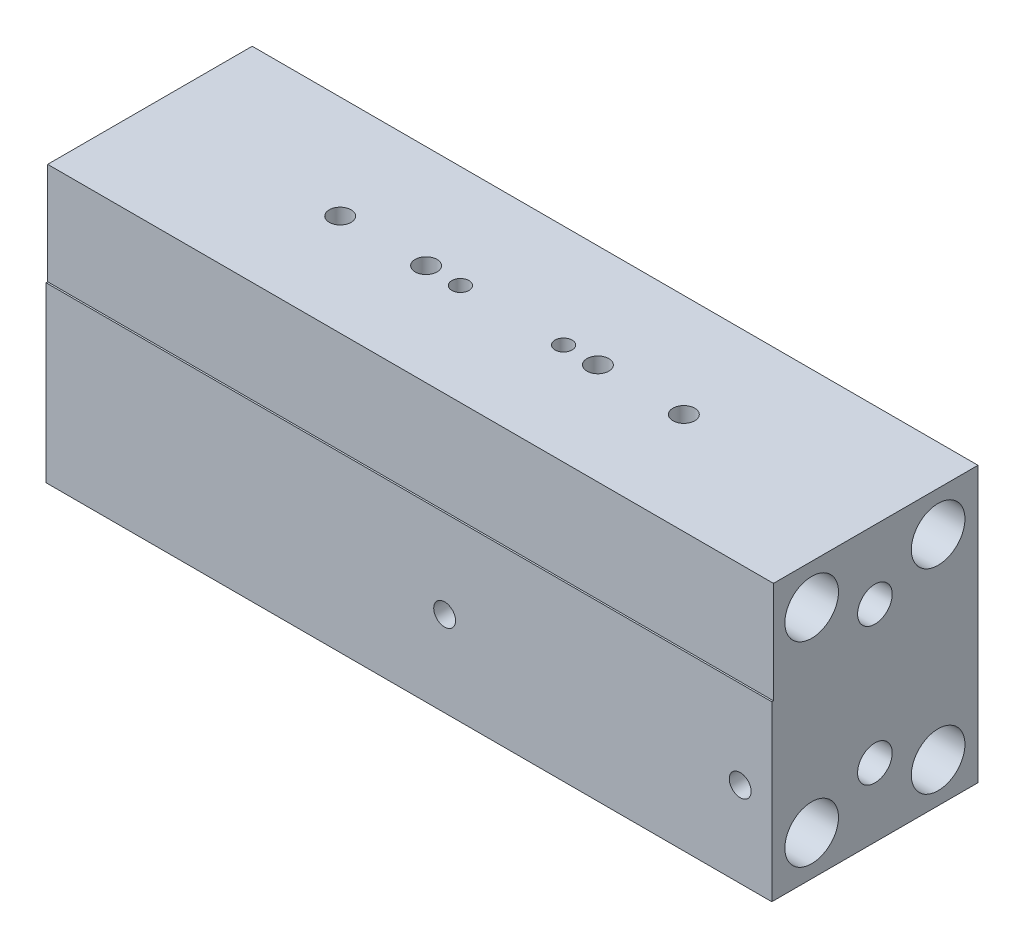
from build123d import *

# Parameters (mm, degrees)
SKETCH1_W                        = 134.112
SKETCH1_H                        = 50.8
EXTRUDE1_DEPTH                   = 38.1
SKETCH22_W                       = 0.3048
SKETCH22_H                       = 18.796
CUT_EXTRUDE1_DEPTH               = 134.112
F_1_8_0_125_DIAMETER_HOLE3_D     = 3.175
F_1_8_0_125_DIAMETER_HOLE3_DEPTH = 6.35
F_1_8_0_125_DIAMETER_HOLE3_TIP   = 0.953866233
SKETCH26_R                       = 4.953
SKETCH26_R_2                     = 3.2004
CUT_EXTRUDE2_DEPTH               = 138.819051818
F_8_32_TAPPED_HOLE1_D            = 3.4544
F_8_32_TAPPED_HOLE1_DEPTH        = 7.1374
F_8_32_TAPPED_HOLE1_TIP          = 0.997199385
F_10_32_TAPPED_HOLE2_D           = 4.0386
F_10_32_TAPPED_HOLE2_DEPTH       = 12.0396
F_10_32_TAPPED_HOLE2_TIP         = 1.165843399
F_10_32_TAPPED_HOLE3_D           = 4.0386
F_10_32_TAPPED_HOLE3_DEPTH       = 8.7376
F_10_32_TAPPED_HOLE3_TIP         = 1.165843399
SKETCH34_R                       = 1.6002
CUT_EXTRUDE3_DEPTH               = 19.05
F_1_8_0_125_DIAMETER_HOLE2_D     = 3.175
F_1_8_0_125_DIAMETER_HOLE2_DEPTH = 4.7752
F_1_8_0_125_DIAMETER_HOLE2_TIP   = 0.953866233


with BuildPart() as part:
    # Sketch1 → Extrude1 (new body)
    with BuildSketch(Plane.XY.offset(-19.05)):
        Rectangle(SKETCH1_W, SKETCH1_H)
    extrude(amount=EXTRUDE1_DEPTH)

    # Sketch22 → Cut-Extrude1 (cut)
    with BuildSketch(Plane(origin=(67.056, 0, 0), x_dir=(0, 0, -1), z_dir=(1, 0, 0))):
        with Locations((-18.8976, 16.002)):
            Rectangle(SKETCH22_W, SKETCH22_H)
    extrude(amount=-CUT_EXTRUDE1_DEPTH, mode=Mode.SUBTRACT)

    # 1_8 _0.125_ Diameter Hole3
    with Locations(Plane(origin=(0, 25.4, 0), x_dir=(-1, 0, 0), z_dir=(0, 1, 0))):
        with Locations((9.525, 0), (-9.525, 0)):
            Hole(F_1_8_0_125_DIAMETER_HOLE3_D / 2, depth=F_1_8_0_125_DIAMETER_HOLE3_DEPTH)
            with Locations((0, 0, -(F_1_8_0_125_DIAMETER_HOLE3_DEPTH + F_1_8_0_125_DIAMETER_HOLE3_TIP / 2))):  # 118° drill point
                Cone(0, F_1_8_0_125_DIAMETER_HOLE3_D / 2, F_1_8_0_125_DIAMETER_HOLE3_TIP, mode=Mode.SUBTRACT)

    # Sketch26 → Cut-Extrude2 (cut, through all)
    with BuildSketch(Plane(origin=(67.056, 0, 0), x_dir=(0, 0, -1), z_dir=(1, 0, 0))):
        with Locations((-11.684, 18.034)):
            Circle(SKETCH26_R)
        with Locations((11.684, 18.034)):
            Circle(SKETCH26_R)
        with Locations((-11.684, -18.034)):
            Circle(SKETCH26_R)
        with Locations((11.684, -18.034)):
            Circle(SKETCH26_R)
        with Locations((0, 12.7)):
            Circle(SKETCH26_R_2)
        with Locations((0, -12.7)):
            Circle(SKETCH26_R_2)
    extrude(amount=-CUT_EXTRUDE2_DEPTH, mode=Mode.SUBTRACT)

    # 8-32 Tapped Hole1
    with Locations(Plane(origin=(0, 0, -19.05), x_dir=(-1, 0, 0), z_dir=(0, 0, -1))):
        with Locations((25.4, 7.9375), (-25.4, 7.9375), (-25.4, -7.9375), (25.4, -7.9375)):
            Hole(F_8_32_TAPPED_HOLE1_D / 2, depth=F_8_32_TAPPED_HOLE1_DEPTH)
            with Locations((0, 0, -(F_8_32_TAPPED_HOLE1_DEPTH + F_8_32_TAPPED_HOLE1_TIP / 2))):  # 120° drill point
                Cone(0, F_8_32_TAPPED_HOLE1_D / 2, F_8_32_TAPPED_HOLE1_TIP, mode=Mode.SUBTRACT)

    # 10-32 Tapped Hole2
    with Locations(Plane.XY.offset(19.05)):
        with Locations((6.604, -9.652), (61.214, -9.652)):
            Hole(F_10_32_TAPPED_HOLE2_D / 2, depth=F_10_32_TAPPED_HOLE2_DEPTH)
            with Locations((0, 0, -(F_10_32_TAPPED_HOLE2_DEPTH + F_10_32_TAPPED_HOLE2_TIP / 2))):  # 120° drill point
                Cone(0, F_10_32_TAPPED_HOLE2_D / 2, F_10_32_TAPPED_HOLE2_TIP, mode=Mode.SUBTRACT)

    # 10-32 Tapped Hole3
    with Locations(Plane(origin=(0, 25.4, 0), x_dir=(-1, 0, 0), z_dir=(0, 1, 0))):
        with Locations((-15.875, 0), (31.75, 0), (15.875, 0), (-31.75, 0)):
            Hole(F_10_32_TAPPED_HOLE3_D / 2, depth=F_10_32_TAPPED_HOLE3_DEPTH)
            with Locations((0, 0, -(F_10_32_TAPPED_HOLE3_DEPTH + F_10_32_TAPPED_HOLE3_TIP / 2))):  # 120° drill point
                Cone(0, F_10_32_TAPPED_HOLE3_D / 2, F_10_32_TAPPED_HOLE3_TIP, mode=Mode.SUBTRACT)

    # Sketch34 → Cut-Extrude3 (cut)
    with BuildSketch(Plane(origin=(0, 0, -19.05), x_dir=(-1, 0, 0), z_dir=(0, 0, -1))):
        with Locations((0, 7.9375)):
            Circle(SKETCH34_R)
        with Locations((0, -7.9375)):
            Circle(SKETCH34_R)
    extrude(amount=-CUT_EXTRUDE3_DEPTH, mode=Mode.SUBTRACT)

    # 1_8 _0.125_ Diameter Hole2
    with Locations(Plane(origin=(0, 0, -19.05), x_dir=(-1, 0, 0), z_dir=(0, 0, -1))):
        with Locations((-31.75, 0), (31.75, 0)):
            Hole(F_1_8_0_125_DIAMETER_HOLE2_D / 2, depth=F_1_8_0_125_DIAMETER_HOLE2_DEPTH)
            with Locations((0, 0, -(F_1_8_0_125_DIAMETER_HOLE2_DEPTH + F_1_8_0_125_DIAMETER_HOLE2_TIP / 2))):  # 118° drill point
                Cone(0, F_1_8_0_125_DIAMETER_HOLE2_D / 2, F_1_8_0_125_DIAMETER_HOLE2_TIP, mode=Mode.SUBTRACT)


solid = part.part
